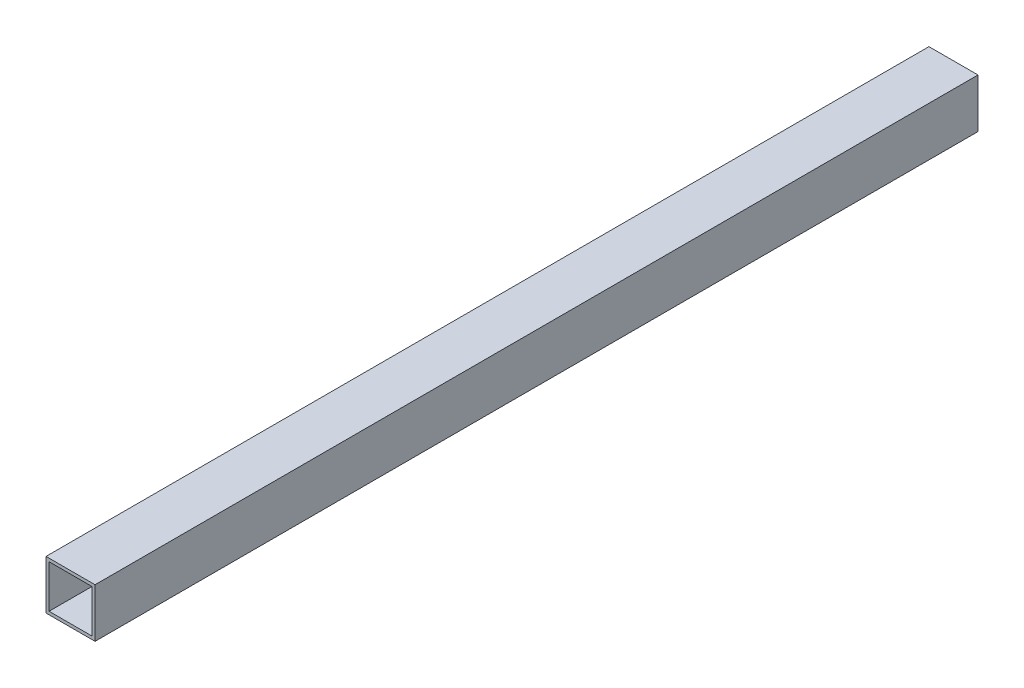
ISO-10303-21;
HEADER;
FILE_DESCRIPTION(('STEP AP214'),'2;1');
FILE_NAME('part.step','',(''),(''),'','','');
FILE_SCHEMA(('AUTOMOTIVE_DESIGN { 1 0 10303 214 1 1 1 1 }'));
ENDSEC;
DATA;
#1=APPLICATION_CONTEXT('core data for automotive mechanical design processes');
#2=APPLICATION_PROTOCOL_DEFINITION('international standard','automotive_design',2000,#1);
#3=PRODUCT_CONTEXT('',#1,'mechanical');
#4=PRODUCT('Part','Part','',(#3));
#5=PRODUCT_RELATED_PRODUCT_CATEGORY('part','',(#4));
#6=PRODUCT_DEFINITION_FORMATION('','',#4);
#7=PRODUCT_DEFINITION_CONTEXT('part definition',#1,'design');
#8=PRODUCT_DEFINITION('design','',#6,#7);
#9=PRODUCT_DEFINITION_SHAPE('','',#8);
#10=(LENGTH_UNIT() NAMED_UNIT(*) SI_UNIT(.MILLI.,.METRE.));
#11=(NAMED_UNIT(*) PLANE_ANGLE_UNIT() SI_UNIT($,.RADIAN.));
#12=(NAMED_UNIT(*) SI_UNIT($,.STERADIAN.) SOLID_ANGLE_UNIT());
#13=UNCERTAINTY_MEASURE_WITH_UNIT(LENGTH_MEASURE(1.E-05),#10,'distance_accuracy_value','');
#14=(GEOMETRIC_REPRESENTATION_CONTEXT(3) GLOBAL_UNCERTAINTY_ASSIGNED_CONTEXT((#13)) GLOBAL_UNIT_ASSIGNED_CONTEXT((#10,
#11,#12)) REPRESENTATION_CONTEXT('',''));
#15=CARTESIAN_POINT('',(0.,0.,0.));
#16=DIRECTION('',(0.,0.,1.));
#17=DIRECTION('',(1.,0.,0.));
#18=AXIS2_PLACEMENT_3D('',#15,#16,#17);
#19=CARTESIAN_POINT('',(0.,25.4,457.2));
#20=DIRECTION('',(0.,0.,-1.));
#21=DIRECTION('',(-1.,0.,0.));
#22=AXIS2_PLACEMENT_3D('',#19,#20,#21);
#23=PLANE('',#22);
#24=DIRECTION('',(0.,-1.,0.));
#25=VECTOR('',#24,1.);
#26=CARTESIAN_POINT('',(0.,0.,457.2));
#27=LINE('',#26,#25);
#28=CARTESIAN_POINT('',(0.,25.4,457.2));
#29=VERTEX_POINT('',#28);
#30=CARTESIAN_POINT('',(0.,0.,457.2));
#31=VERTEX_POINT('',#30);
#32=EDGE_CURVE('E132',#29,#31,#27,.T.);
#33=ORIENTED_EDGE('',*,*,#32,.T.);
#34=DIRECTION('',(1.,0.,0.));
#35=VECTOR('',#34,1.);
#36=CARTESIAN_POINT('',(0.,0.,457.2));
#37=LINE('',#36,#35);
#38=CARTESIAN_POINT('',(25.4,0.,457.2));
#39=VERTEX_POINT('',#38);
#40=EDGE_CURVE('E135',#31,#39,#37,.T.);
#41=ORIENTED_EDGE('',*,*,#40,.T.);
#42=DIRECTION('',(0.,1.,0.));
#43=VECTOR('',#42,1.);
#44=CARTESIAN_POINT('',(25.4,0.,457.2));
#45=LINE('',#44,#43);
#46=CARTESIAN_POINT('',(25.4,25.4,457.2));
#47=VERTEX_POINT('',#46);
#48=EDGE_CURVE('E138',#39,#47,#45,.T.);
#49=ORIENTED_EDGE('',*,*,#48,.T.);
#50=DIRECTION('',(-1.,0.,0.));
#51=VECTOR('',#50,1.);
#52=CARTESIAN_POINT('',(0.,25.4,457.2));
#53=LINE('',#52,#51);
#54=EDGE_CURVE('E140',#47,#29,#53,.T.);
#55=ORIENTED_EDGE('',*,*,#54,.T.);
#56=EDGE_LOOP('',(#33,#41,#49,#55));
#57=FACE_BOUND('',#56,.T.);
#58=DIRECTION('',(0.,-1.,0.));
#59=VECTOR('',#58,1.);
#60=CARTESIAN_POINT('',(1.5875,1.5875,457.2));
#61=LINE('',#60,#59);
#62=CARTESIAN_POINT('',(1.5875,23.8125,457.2));
#63=VERTEX_POINT('',#62);
#64=CARTESIAN_POINT('',(1.5875,1.5875,457.2));
#65=VERTEX_POINT('',#64);
#66=EDGE_CURVE('E96',#63,#65,#61,.T.);
#67=ORIENTED_EDGE('',*,*,#66,.F.);
#68=DIRECTION('',(-1.,0.,0.));
#69=VECTOR('',#68,1.);
#70=CARTESIAN_POINT('',(1.5875,23.8125,457.2));
#71=LINE('',#70,#69);
#72=CARTESIAN_POINT('',(23.8125,23.8125,457.2));
#73=VERTEX_POINT('',#72);
#74=EDGE_CURVE('E118',#73,#63,#71,.T.);
#75=ORIENTED_EDGE('',*,*,#74,.F.);
#76=DIRECTION('',(0.,1.,0.));
#77=VECTOR('',#76,1.);
#78=CARTESIAN_POINT('',(23.8125,1.5875,457.2));
#79=LINE('',#78,#77);
#80=CARTESIAN_POINT('',(23.8125,1.5875,457.2));
#81=VERTEX_POINT('',#80);
#82=EDGE_CURVE('E116',#81,#73,#79,.T.);
#83=ORIENTED_EDGE('',*,*,#82,.F.);
#84=DIRECTION('',(1.,0.,0.));
#85=VECTOR('',#84,1.);
#86=CARTESIAN_POINT('',(1.5875,1.5875,457.2));
#87=LINE('',#86,#85);
#88=EDGE_CURVE('E104',#65,#81,#87,.T.);
#89=ORIENTED_EDGE('',*,*,#88,.F.);
#90=EDGE_LOOP('',(#67,#75,#83,#89));
#91=FACE_BOUND('',#90,.T.);
#92=ADVANCED_FACE('F31',(#57,#91),#23,.F.);
#93=CARTESIAN_POINT('',(0.,25.4,0.));
#94=DIRECTION('',(0.,0.,-1.));
#95=DIRECTION('',(-1.,0.,0.));
#96=AXIS2_PLACEMENT_3D('',#93,#94,#95);
#97=PLANE('',#96);
#98=DIRECTION('',(0.,-1.,0.));
#99=VECTOR('',#98,1.);
#100=CARTESIAN_POINT('',(0.,0.,0.));
#101=LINE('',#100,#99);
#102=CARTESIAN_POINT('',(0.,25.4,0.));
#103=VERTEX_POINT('',#102);
#104=CARTESIAN_POINT('',(0.,0.,0.));
#105=VERTEX_POINT('',#104);
#106=EDGE_CURVE('E112',#103,#105,#101,.T.);
#107=ORIENTED_EDGE('',*,*,#106,.F.);
#108=DIRECTION('',(-1.,0.,0.));
#109=VECTOR('',#108,1.);
#110=CARTESIAN_POINT('',(0.,25.4,0.));
#111=LINE('',#110,#109);
#112=CARTESIAN_POINT('',(25.4,25.4,0.));
#113=VERTEX_POINT('',#112);
#114=EDGE_CURVE('E136',#113,#103,#111,.T.);
#115=ORIENTED_EDGE('',*,*,#114,.F.);
#116=DIRECTION('',(0.,1.,0.));
#117=VECTOR('',#116,1.);
#118=CARTESIAN_POINT('',(25.4,0.,0.));
#119=LINE('',#118,#117);
#120=CARTESIAN_POINT('',(25.4,0.,0.));
#121=VERTEX_POINT('',#120);
#122=EDGE_CURVE('E147',#121,#113,#119,.T.);
#123=ORIENTED_EDGE('',*,*,#122,.F.);
#124=DIRECTION('',(1.,0.,0.));
#125=VECTOR('',#124,1.);
#126=CARTESIAN_POINT('',(0.,0.,0.));
#127=LINE('',#126,#125);
#128=EDGE_CURVE('E145',#105,#121,#127,.T.);
#129=ORIENTED_EDGE('',*,*,#128,.F.);
#130=EDGE_LOOP('',(#107,#115,#123,#129));
#131=FACE_BOUND('',#130,.T.);
#132=DIRECTION('',(-1.,0.,0.));
#133=VECTOR('',#132,1.);
#134=CARTESIAN_POINT('',(1.5875,23.8125,0.));
#135=LINE('',#134,#133);
#136=CARTESIAN_POINT('',(23.8125,23.8125,0.));
#137=VERTEX_POINT('',#136);
#138=CARTESIAN_POINT('',(1.5875,23.8125,0.));
#139=VERTEX_POINT('',#138);
#140=EDGE_CURVE('E105',#137,#139,#135,.T.);
#141=ORIENTED_EDGE('',*,*,#140,.T.);
#142=DIRECTION('',(0.,-1.,0.));
#143=VECTOR('',#142,1.);
#144=CARTESIAN_POINT('',(1.5875,1.5875,0.));
#145=LINE('',#144,#143);
#146=CARTESIAN_POINT('',(1.5875,1.5875,0.));
#147=VERTEX_POINT('',#146);
#148=EDGE_CURVE('E54',#139,#147,#145,.T.);
#149=ORIENTED_EDGE('',*,*,#148,.T.);
#150=DIRECTION('',(1.,0.,0.));
#151=VECTOR('',#150,1.);
#152=CARTESIAN_POINT('',(1.5875,1.5875,0.));
#153=LINE('',#152,#151);
#154=CARTESIAN_POINT('',(23.8125,1.5875,0.));
#155=VERTEX_POINT('',#154);
#156=EDGE_CURVE('E111',#147,#155,#153,.T.);
#157=ORIENTED_EDGE('',*,*,#156,.T.);
#158=DIRECTION('',(0.,1.,0.));
#159=VECTOR('',#158,1.);
#160=CARTESIAN_POINT('',(23.8125,1.5875,0.));
#161=LINE('',#160,#159);
#162=EDGE_CURVE('E124',#155,#137,#161,.T.);
#163=ORIENTED_EDGE('',*,*,#162,.T.);
#164=EDGE_LOOP('',(#141,#149,#157,#163));
#165=FACE_BOUND('',#164,.T.);
#166=ADVANCED_FACE('F165',(#131,#165),#97,.T.);
#167=CARTESIAN_POINT('',(0.,0.,457.2));
#168=DIRECTION('',(1.,0.,0.));
#169=DIRECTION('',(0.,0.,-1.));
#170=AXIS2_PLACEMENT_3D('',#167,#168,#169);
#171=PLANE('',#170);
#172=ORIENTED_EDGE('',*,*,#106,.T.);
#173=DIRECTION('',(0.,0.,-1.));
#174=VECTOR('',#173,1.);
#175=CARTESIAN_POINT('',(0.,0.,457.2));
#176=LINE('',#175,#174);
#177=EDGE_CURVE('E11',#31,#105,#176,.T.);
#178=ORIENTED_EDGE('',*,*,#177,.F.);
#179=ORIENTED_EDGE('',*,*,#32,.F.);
#180=DIRECTION('',(0.,0.,-1.));
#181=VECTOR('',#180,1.);
#182=CARTESIAN_POINT('',(0.,25.4,457.2));
#183=LINE('',#182,#181);
#184=EDGE_CURVE('E142',#29,#103,#183,.T.);
#185=ORIENTED_EDGE('',*,*,#184,.T.);
#186=EDGE_LOOP('',(#172,#178,#179,#185));
#187=FACE_BOUND('',#186,.T.);
#188=ADVANCED_FACE('F33',(#187),#171,.F.);
#189=CARTESIAN_POINT('',(0.,0.,457.2));
#190=DIRECTION('',(0.,1.,0.));
#191=DIRECTION('',(0.,0.,1.));
#192=AXIS2_PLACEMENT_3D('',#189,#190,#191);
#193=PLANE('',#192);
#194=ORIENTED_EDGE('',*,*,#128,.T.);
#195=DIRECTION('',(0.,0.,-1.));
#196=VECTOR('',#195,1.);
#197=CARTESIAN_POINT('',(25.4,0.,457.2));
#198=LINE('',#197,#196);
#199=EDGE_CURVE('E39',#39,#121,#198,.T.);
#200=ORIENTED_EDGE('',*,*,#199,.F.);
#201=ORIENTED_EDGE('',*,*,#40,.F.);
#202=ORIENTED_EDGE('',*,*,#177,.T.);
#203=EDGE_LOOP('',(#194,#200,#201,#202));
#204=FACE_BOUND('',#203,.T.);
#205=ADVANCED_FACE('F175',(#204),#193,.F.);
#206=CARTESIAN_POINT('',(25.4,0.,457.2));
#207=DIRECTION('',(-1.,0.,0.));
#208=DIRECTION('',(0.,0.,1.));
#209=AXIS2_PLACEMENT_3D('',#206,#207,#208);
#210=PLANE('',#209);
#211=ORIENTED_EDGE('',*,*,#122,.T.);
#212=DIRECTION('',(0.,0.,-1.));
#213=VECTOR('',#212,1.);
#214=CARTESIAN_POINT('',(25.4,25.4,457.2));
#215=LINE('',#214,#213);
#216=EDGE_CURVE('E152',#47,#113,#215,.T.);
#217=ORIENTED_EDGE('',*,*,#216,.F.);
#218=ORIENTED_EDGE('',*,*,#48,.F.);
#219=ORIENTED_EDGE('',*,*,#199,.T.);
#220=EDGE_LOOP('',(#211,#217,#218,#219));
#221=FACE_BOUND('',#220,.T.);
#222=ADVANCED_FACE('F159',(#221),#210,.F.);
#223=CARTESIAN_POINT('',(0.,25.4,457.2));
#224=DIRECTION('',(0.,-1.,0.));
#225=DIRECTION('',(0.,0.,-1.));
#226=AXIS2_PLACEMENT_3D('',#223,#224,#225);
#227=PLANE('',#226);
#228=ORIENTED_EDGE('',*,*,#114,.T.);
#229=ORIENTED_EDGE('',*,*,#184,.F.);
#230=ORIENTED_EDGE('',*,*,#54,.F.);
#231=ORIENTED_EDGE('',*,*,#216,.T.);
#232=EDGE_LOOP('',(#228,#229,#230,#231));
#233=FACE_BOUND('',#232,.T.);
#234=ADVANCED_FACE('F169',(#233),#227,.F.);
#235=CARTESIAN_POINT('',(1.5875,1.5875,457.2));
#236=DIRECTION('',(1.,0.,0.));
#237=DIRECTION('',(0.,1.,0.));
#238=AXIS2_PLACEMENT_3D('',#235,#236,#237);
#239=PLANE('',#238);
#240=ORIENTED_EDGE('',*,*,#148,.F.);
#241=DIRECTION('',(0.,0.,-1.));
#242=VECTOR('',#241,1.);
#243=CARTESIAN_POINT('',(1.5875,23.8125,457.2));
#244=LINE('',#243,#242);
#245=EDGE_CURVE('E100',#63,#139,#244,.T.);
#246=ORIENTED_EDGE('',*,*,#245,.F.);
#247=ORIENTED_EDGE('',*,*,#66,.T.);
#248=DIRECTION('',(0.,0.,-1.));
#249=VECTOR('',#248,1.);
#250=CARTESIAN_POINT('',(1.5875,1.5875,457.2));
#251=LINE('',#250,#249);
#252=EDGE_CURVE('E99',#65,#147,#251,.T.);
#253=ORIENTED_EDGE('',*,*,#252,.T.);
#254=EDGE_LOOP('',(#240,#246,#247,#253));
#255=FACE_BOUND('',#254,.T.);
#256=ADVANCED_FACE('F98',(#255),#239,.T.);
#257=CARTESIAN_POINT('',(1.5875,1.5875,457.2));
#258=DIRECTION('',(0.,1.,0.));
#259=DIRECTION('',(-1.,0.,0.));
#260=AXIS2_PLACEMENT_3D('',#257,#258,#259);
#261=PLANE('',#260);
#262=ORIENTED_EDGE('',*,*,#156,.F.);
#263=ORIENTED_EDGE('',*,*,#252,.F.);
#264=ORIENTED_EDGE('',*,*,#88,.T.);
#265=DIRECTION('',(0.,0.,-1.));
#266=VECTOR('',#265,1.);
#267=CARTESIAN_POINT('',(23.8125,1.5875,457.2));
#268=LINE('',#267,#266);
#269=EDGE_CURVE('E113',#81,#155,#268,.T.);
#270=ORIENTED_EDGE('',*,*,#269,.T.);
#271=EDGE_LOOP('',(#262,#263,#264,#270));
#272=FACE_BOUND('',#271,.T.);
#273=ADVANCED_FACE('F108',(#272),#261,.T.);
#274=CARTESIAN_POINT('',(23.8125,1.5875,457.2));
#275=DIRECTION('',(-1.,0.,0.));
#276=DIRECTION('',(0.,-1.,0.));
#277=AXIS2_PLACEMENT_3D('',#274,#275,#276);
#278=PLANE('',#277);
#279=ORIENTED_EDGE('',*,*,#162,.F.);
#280=ORIENTED_EDGE('',*,*,#269,.F.);
#281=ORIENTED_EDGE('',*,*,#82,.T.);
#282=DIRECTION('',(0.,0.,-1.));
#283=VECTOR('',#282,1.);
#284=CARTESIAN_POINT('',(23.8125,23.8125,457.2));
#285=LINE('',#284,#283);
#286=EDGE_CURVE('E46',#73,#137,#285,.T.);
#287=ORIENTED_EDGE('',*,*,#286,.T.);
#288=EDGE_LOOP('',(#279,#280,#281,#287));
#289=FACE_BOUND('',#288,.T.);
#290=ADVANCED_FACE('F198',(#289),#278,.T.);
#291=CARTESIAN_POINT('',(1.5875,23.8125,457.2));
#292=DIRECTION('',(0.,-1.,0.));
#293=DIRECTION('',(0.,0.,-1.));
#294=AXIS2_PLACEMENT_3D('',#291,#292,#293);
#295=PLANE('',#294);
#296=ORIENTED_EDGE('',*,*,#140,.F.);
#297=ORIENTED_EDGE('',*,*,#286,.F.);
#298=ORIENTED_EDGE('',*,*,#74,.T.);
#299=ORIENTED_EDGE('',*,*,#245,.T.);
#300=EDGE_LOOP('',(#296,#297,#298,#299));
#301=FACE_BOUND('',#300,.T.);
#302=ADVANCED_FACE('F202',(#301),#295,.T.);
#303=CLOSED_SHELL('',(#92,#166,#188,#205,#222,#234,#256,#273,#290,#302));
#304=MANIFOLD_SOLID_BREP('B2',#303);
#305=ADVANCED_BREP_SHAPE_REPRESENTATION('',(#18,#304),#14);
#306=SHAPE_DEFINITION_REPRESENTATION(#9,#305);
ENDSEC;
END-ISO-10303-21;
